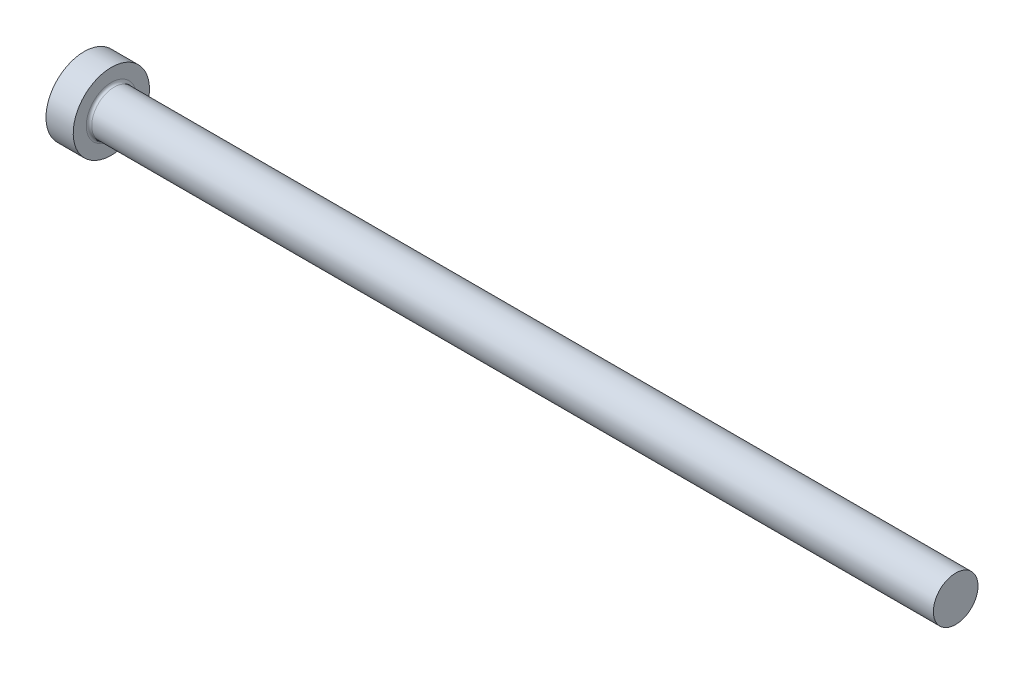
ISO-10303-21;
HEADER;
FILE_DESCRIPTION(('STEP AP214'),'2;1');
FILE_NAME('part.step','',(''),(''),'','','');
FILE_SCHEMA(('AUTOMOTIVE_DESIGN { 1 0 10303 214 1 1 1 1 }'));
ENDSEC;
DATA;
#1=APPLICATION_CONTEXT('core data for automotive mechanical design processes');
#2=APPLICATION_PROTOCOL_DEFINITION('international standard','automotive_design',2000,#1);
#3=PRODUCT_CONTEXT('',#1,'mechanical');
#4=PRODUCT('Part','Part','',(#3));
#5=PRODUCT_RELATED_PRODUCT_CATEGORY('part','',(#4));
#6=PRODUCT_DEFINITION_FORMATION('','',#4);
#7=PRODUCT_DEFINITION_CONTEXT('part definition',#1,'design');
#8=PRODUCT_DEFINITION('design','',#6,#7);
#9=PRODUCT_DEFINITION_SHAPE('','',#8);
#10=(LENGTH_UNIT() NAMED_UNIT(*) SI_UNIT(.MILLI.,.METRE.));
#11=(NAMED_UNIT(*) PLANE_ANGLE_UNIT() SI_UNIT($,.RADIAN.));
#12=(NAMED_UNIT(*) SI_UNIT($,.STERADIAN.) SOLID_ANGLE_UNIT());
#13=UNCERTAINTY_MEASURE_WITH_UNIT(LENGTH_MEASURE(1.E-05),#10,'distance_accuracy_value','');
#14=(GEOMETRIC_REPRESENTATION_CONTEXT(3) GLOBAL_UNCERTAINTY_ASSIGNED_CONTEXT((#13)) GLOBAL_UNIT_ASSIGNED_CONTEXT((#10,
#11,#12)) REPRESENTATION_CONTEXT('',''));
#15=CARTESIAN_POINT('',(0.,0.,0.));
#16=DIRECTION('',(0.,0.,1.));
#17=DIRECTION('',(1.,0.,0.));
#18=AXIS2_PLACEMENT_3D('',#15,#16,#17);
#19=CARTESIAN_POINT('',(0.,0.,0.));
#20=DIRECTION('',(-1.,0.,0.));
#21=DIRECTION('',(0.,-1.,0.));
#22=AXIS2_PLACEMENT_3D('',#19,#20,#21);
#23=PLANE('',#22);
#24=CARTESIAN_POINT('',(0.,0.,0.));
#25=DIRECTION('',(1.,0.,0.));
#26=DIRECTION('',(0.,1.,0.));
#27=AXIS2_PLACEMENT_3D('',#24,#25,#26);
#28=CIRCLE('',#27,7.);
#29=CARTESIAN_POINT('',(0.,7.,0.));
#30=VERTEX_POINT('',#29);
#31=EDGE_CURVE('E25',#30,#30,#28,.T.);
#32=ORIENTED_EDGE('',*,*,#31,.F.);
#33=EDGE_LOOP('',(#32));
#34=FACE_BOUND('',#33,.T.);
#35=ADVANCED_FACE('F14',(#34),#23,.T.);
#36=CARTESIAN_POINT('',(160.,0.,0.));
#37=DIRECTION('',(1.,0.,0.));
#38=DIRECTION('',(0.,1.,0.));
#39=AXIS2_PLACEMENT_3D('',#36,#37,#38);
#40=CYLINDRICAL_SURFACE('',#39,7.);
#41=ORIENTED_EDGE('',*,*,#31,.T.);
#42=EDGE_LOOP('',(#41));
#43=FACE_BOUND('',#42,.T.);
#44=CARTESIAN_POINT('',(5.,0.,0.));
#45=DIRECTION('',(1.,0.,0.));
#46=DIRECTION('',(0.,1.,0.));
#47=AXIS2_PLACEMENT_3D('',#44,#45,#46);
#48=CIRCLE('',#47,7.);
#49=CARTESIAN_POINT('',(5.,7.,0.));
#50=VERTEX_POINT('',#49);
#51=EDGE_CURVE('E29',#50,#50,#48,.T.);
#52=ORIENTED_EDGE('',*,*,#51,.F.);
#53=EDGE_LOOP('',(#52));
#54=FACE_BOUND('',#53,.T.);
#55=ADVANCED_FACE('F51',(#43,#54),#40,.T.);
#56=CARTESIAN_POINT('',(5.,7.,0.));
#57=DIRECTION('',(1.,0.,0.));
#58=DIRECTION('',(0.,1.,0.));
#59=AXIS2_PLACEMENT_3D('',#56,#57,#58);
#60=PLANE('',#59);
#61=CARTESIAN_POINT('',(5.,0.,0.));
#62=DIRECTION('',(1.,0.,0.));
#63=DIRECTION('',(0.,1.,0.));
#64=AXIS2_PLACEMENT_3D('',#61,#62,#63);
#65=CIRCLE('',#64,4.6);
#66=CARTESIAN_POINT('',(5.,4.6,0.));
#67=VERTEX_POINT('',#66);
#68=EDGE_CURVE('E9',#67,#67,#65,.F.);
#69=ORIENTED_EDGE('',*,*,#68,.T.);
#70=EDGE_LOOP('',(#69));
#71=FACE_BOUND('',#70,.T.);
#72=ORIENTED_EDGE('',*,*,#51,.T.);
#73=EDGE_LOOP('',(#72));
#74=FACE_BOUND('',#73,.T.);
#75=ADVANCED_FACE('F42',(#71,#74),#60,.T.);
#76=CARTESIAN_POINT('',(160.,0.,0.));
#77=DIRECTION('',(1.,0.,0.));
#78=DIRECTION('',(0.,1.,0.));
#79=AXIS2_PLACEMENT_3D('',#76,#77,#78);
#80=CYLINDRICAL_SURFACE('',#79,4.1);
#81=CARTESIAN_POINT('',(5.5,0.,0.));
#82=DIRECTION('',(1.,0.,0.));
#83=DIRECTION('',(0.,1.,0.));
#84=AXIS2_PLACEMENT_3D('',#81,#82,#83);
#85=CIRCLE('',#84,4.1);
#86=CARTESIAN_POINT('',(5.5,4.1,0.));
#87=VERTEX_POINT('',#86);
#88=EDGE_CURVE('E21',#87,#87,#85,.T.);
#89=ORIENTED_EDGE('',*,*,#88,.T.);
#90=EDGE_LOOP('',(#89));
#91=FACE_BOUND('',#90,.T.);
#92=CARTESIAN_POINT('',(160.,0.,0.));
#93=DIRECTION('',(1.,0.,0.));
#94=DIRECTION('',(0.,1.,0.));
#95=AXIS2_PLACEMENT_3D('',#92,#93,#94);
#96=CIRCLE('',#95,4.1);
#97=CARTESIAN_POINT('',(160.,4.1,0.));
#98=VERTEX_POINT('',#97);
#99=EDGE_CURVE('E34',#98,#98,#96,.T.);
#100=ORIENTED_EDGE('',*,*,#99,.F.);
#101=EDGE_LOOP('',(#100));
#102=FACE_BOUND('',#101,.T.);
#103=ADVANCED_FACE('F40',(#91,#102),#80,.T.);
#104=CARTESIAN_POINT('',(160.,4.1,0.));
#105=DIRECTION('',(1.,0.,0.));
#106=DIRECTION('',(0.,1.,0.));
#107=AXIS2_PLACEMENT_3D('',#104,#105,#106);
#108=PLANE('',#107);
#109=ORIENTED_EDGE('',*,*,#99,.T.);
#110=EDGE_LOOP('',(#109));
#111=FACE_BOUND('',#110,.T.);
#112=ADVANCED_FACE('F38',(#111),#108,.T.);
#113=CARTESIAN_POINT('',(5.5,0.,0.));
#114=DIRECTION('',(1.,0.,0.));
#115=DIRECTION('',(0.,1.,0.));
#116=AXIS2_PLACEMENT_3D('',#113,#114,#115);
#117=TOROIDAL_SURFACE('',#116,4.6,0.5);
#118=ORIENTED_EDGE('',*,*,#68,.F.);
#119=EDGE_LOOP('',(#118));
#120=FACE_BOUND('',#119,.T.);
#121=ORIENTED_EDGE('',*,*,#88,.F.);
#122=EDGE_LOOP('',(#121));
#123=FACE_BOUND('',#122,.T.);
#124=ADVANCED_FACE('F16',(#120,#123),#117,.F.);
#125=CLOSED_SHELL('',(#35,#55,#75,#103,#112,#124));
#126=MANIFOLD_SOLID_BREP('B1',#125);
#127=ADVANCED_BREP_SHAPE_REPRESENTATION('',(#18,#126),#14);
#128=SHAPE_DEFINITION_REPRESENTATION(#9,#127);
ENDSEC;
END-ISO-10303-21;
